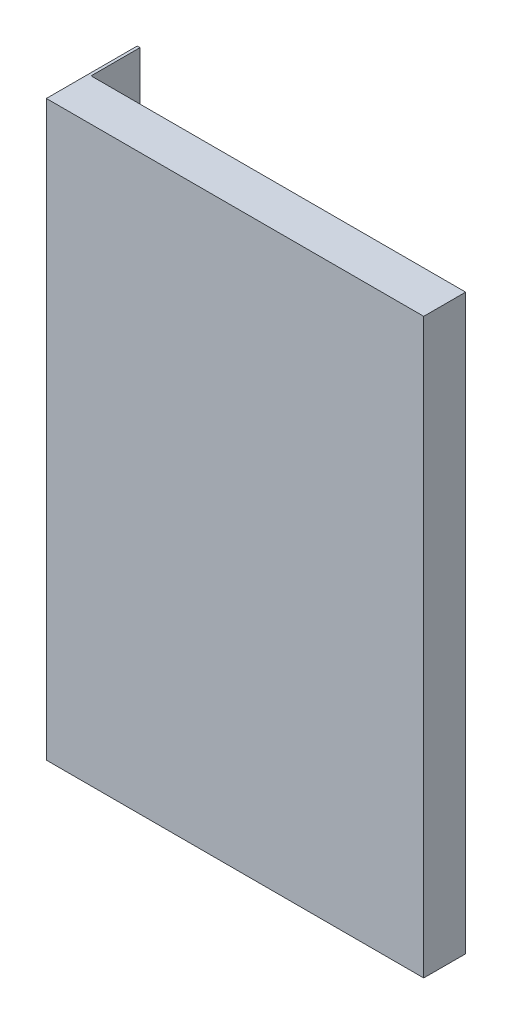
ISO-10303-21;
HEADER;
FILE_DESCRIPTION(('STEP AP214'),'2;1');
FILE_NAME('part.step','',(''),(''),'','','');
FILE_SCHEMA(('AUTOMOTIVE_DESIGN { 1 0 10303 214 1 1 1 1 }'));
ENDSEC;
DATA;
#1=APPLICATION_CONTEXT('core data for automotive mechanical design processes');
#2=APPLICATION_PROTOCOL_DEFINITION('international standard','automotive_design',2000,#1);
#3=PRODUCT_CONTEXT('',#1,'mechanical');
#4=PRODUCT('Part','Part','',(#3));
#5=PRODUCT_RELATED_PRODUCT_CATEGORY('part','',(#4));
#6=PRODUCT_DEFINITION_FORMATION('','',#4);
#7=PRODUCT_DEFINITION_CONTEXT('part definition',#1,'design');
#8=PRODUCT_DEFINITION('design','',#6,#7);
#9=PRODUCT_DEFINITION_SHAPE('','',#8);
#10=(LENGTH_UNIT() NAMED_UNIT(*) SI_UNIT(.MILLI.,.METRE.));
#11=(NAMED_UNIT(*) PLANE_ANGLE_UNIT() SI_UNIT($,.RADIAN.));
#12=(NAMED_UNIT(*) SI_UNIT($,.STERADIAN.) SOLID_ANGLE_UNIT());
#13=UNCERTAINTY_MEASURE_WITH_UNIT(LENGTH_MEASURE(1.E-05),#10,'distance_accuracy_value','');
#14=(GEOMETRIC_REPRESENTATION_CONTEXT(3) GLOBAL_UNCERTAINTY_ASSIGNED_CONTEXT((#13)) GLOBAL_UNIT_ASSIGNED_CONTEXT((#10,
#11,#12)) REPRESENTATION_CONTEXT('',''));
#15=CARTESIAN_POINT('',(0.,0.,0.));
#16=DIRECTION('',(0.,0.,1.));
#17=DIRECTION('',(1.,0.,0.));
#18=AXIS2_PLACEMENT_3D('',#15,#16,#17);
#19=CARTESIAN_POINT('',(-6.,-0.999999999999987,3.5));
#20=DIRECTION('',(-1.,0.,0.));
#21=DIRECTION('',(0.,-1.,0.));
#22=AXIS2_PLACEMENT_3D('',#19,#20,#21);
#23=PLANE('',#22);
#24=DIRECTION('',(0.,1.,0.));
#25=VECTOR('',#24,1.);
#26=CARTESIAN_POINT('',(-6.,-0.999999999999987,0.));
#27=LINE('',#26,#25);
#28=CARTESIAN_POINT('',(-6.,-11.,0.));
#29=VERTEX_POINT('',#28);
#30=CARTESIAN_POINT('',(-6.,-0.999999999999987,0.));
#31=VERTEX_POINT('',#30);
#32=EDGE_CURVE('E167',#29,#31,#27,.T.);
#33=ORIENTED_EDGE('',*,*,#32,.T.);
#34=DIRECTION('',(0.,0.,-1.));
#35=VECTOR('',#34,1.);
#36=CARTESIAN_POINT('',(-6.,-0.999999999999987,3.5));
#37=LINE('',#36,#35);
#38=CARTESIAN_POINT('',(-6.,-0.999999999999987,3.5));
#39=VERTEX_POINT('',#38);
#40=EDGE_CURVE('E11',#39,#31,#37,.T.);
#41=ORIENTED_EDGE('',*,*,#40,.F.);
#42=DIRECTION('',(0.,1.,0.));
#43=VECTOR('',#42,1.);
#44=CARTESIAN_POINT('',(-6.,-0.999999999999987,3.5));
#45=LINE('',#44,#43);
#46=CARTESIAN_POINT('',(-6.,-11.,3.5));
#47=VERTEX_POINT('',#46);
#48=EDGE_CURVE('E176',#47,#39,#45,.T.);
#49=ORIENTED_EDGE('',*,*,#48,.F.);
#50=DIRECTION('',(0.,0.,-1.));
#51=VECTOR('',#50,1.);
#52=CARTESIAN_POINT('',(-6.,-11.,3.5));
#53=LINE('',#52,#51);
#54=EDGE_CURVE('E188',#47,#29,#53,.T.);
#55=ORIENTED_EDGE('',*,*,#54,.T.);
#56=EDGE_LOOP('',(#33,#41,#49,#55));
#57=FACE_BOUND('',#56,.T.);
#58=ADVANCED_FACE('F35',(#57),#23,.F.);
#59=CARTESIAN_POINT('',(-6.,-0.999999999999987,3.5));
#60=DIRECTION('',(0.,-1.,0.));
#61=DIRECTION('',(1.,0.,0.));
#62=AXIS2_PLACEMENT_3D('',#59,#60,#61);
#63=PLANE('',#62);
#64=DIRECTION('',(-1.,0.,0.));
#65=VECTOR('',#64,1.);
#66=CARTESIAN_POINT('',(-6.,-0.999999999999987,0.));
#67=LINE('',#66,#65);
#68=CARTESIAN_POINT('',(-16.,-0.999999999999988,0.));
#69=VERTEX_POINT('',#68);
#70=EDGE_CURVE('E170',#31,#69,#67,.T.);
#71=ORIENTED_EDGE('',*,*,#70,.T.);
#72=DIRECTION('',(0.,0.,-1.));
#73=VECTOR('',#72,1.);
#74=CARTESIAN_POINT('',(-16.,-0.999999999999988,3.5));
#75=LINE('',#74,#73);
#76=CARTESIAN_POINT('',(-16.,-0.999999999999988,3.5));
#77=VERTEX_POINT('',#76);
#78=EDGE_CURVE('E42',#77,#69,#75,.T.);
#79=ORIENTED_EDGE('',*,*,#78,.F.);
#80=DIRECTION('',(-1.,0.,0.));
#81=VECTOR('',#80,1.);
#82=CARTESIAN_POINT('',(-6.,-0.999999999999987,3.5));
#83=LINE('',#82,#81);
#84=EDGE_CURVE('E179',#39,#77,#83,.T.);
#85=ORIENTED_EDGE('',*,*,#84,.F.);
#86=ORIENTED_EDGE('',*,*,#40,.T.);
#87=EDGE_LOOP('',(#71,#79,#85,#86));
#88=FACE_BOUND('',#87,.T.);
#89=ADVANCED_FACE('F204',(#88),#63,.F.);
#90=CARTESIAN_POINT('',(-16.,-0.999999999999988,3.5));
#91=DIRECTION('',(1.,0.,0.));
#92=DIRECTION('',(0.,0.,-1.));
#93=AXIS2_PLACEMENT_3D('',#90,#91,#92);
#94=PLANE('',#93);
#95=DIRECTION('',(0.,-1.,0.));
#96=VECTOR('',#95,1.);
#97=CARTESIAN_POINT('',(-16.,-0.999999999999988,0.));
#98=LINE('',#97,#96);
#99=CARTESIAN_POINT('',(-16.,-11.,0.));
#100=VERTEX_POINT('',#99);
#101=EDGE_CURVE('E172',#69,#100,#98,.T.);
#102=ORIENTED_EDGE('',*,*,#101,.T.);
#103=DIRECTION('',(0.,0.,-1.));
#104=VECTOR('',#103,1.);
#105=CARTESIAN_POINT('',(-16.,-11.,3.5));
#106=LINE('',#105,#104);
#107=CARTESIAN_POINT('',(-16.,-11.,3.5));
#108=VERTEX_POINT('',#107);
#109=EDGE_CURVE('E49',#108,#100,#106,.T.);
#110=ORIENTED_EDGE('',*,*,#109,.F.);
#111=DIRECTION('',(0.,-1.,0.));
#112=VECTOR('',#111,1.);
#113=CARTESIAN_POINT('',(-16.,-0.999999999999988,3.5));
#114=LINE('',#113,#112);
#115=EDGE_CURVE('E182',#77,#108,#114,.T.);
#116=ORIENTED_EDGE('',*,*,#115,.F.);
#117=ORIENTED_EDGE('',*,*,#78,.T.);
#118=EDGE_LOOP('',(#102,#110,#116,#117));
#119=FACE_BOUND('',#118,.T.);
#120=ADVANCED_FACE('F192',(#119),#94,.F.);
#121=CARTESIAN_POINT('',(-6.,-11.,3.5));
#122=DIRECTION('',(0.,1.,0.));
#123=DIRECTION('',(-1.,0.,0.));
#124=AXIS2_PLACEMENT_3D('',#121,#122,#123);
#125=PLANE('',#124);
#126=DIRECTION('',(1.,0.,0.));
#127=VECTOR('',#126,1.);
#128=CARTESIAN_POINT('',(-6.,-11.,0.));
#129=LINE('',#128,#127);
#130=EDGE_CURVE('E174',#100,#29,#129,.T.);
#131=ORIENTED_EDGE('',*,*,#130,.T.);
#132=ORIENTED_EDGE('',*,*,#54,.F.);
#133=DIRECTION('',(1.,0.,0.));
#134=VECTOR('',#133,1.);
#135=CARTESIAN_POINT('',(-6.,-11.,3.5));
#136=LINE('',#135,#134);
#137=EDGE_CURVE('E185',#108,#47,#136,.T.);
#138=ORIENTED_EDGE('',*,*,#137,.F.);
#139=ORIENTED_EDGE('',*,*,#109,.T.);
#140=EDGE_LOOP('',(#131,#132,#138,#139));
#141=FACE_BOUND('',#140,.T.);
#142=ADVANCED_FACE('F199',(#141),#125,.F.);
#143=CARTESIAN_POINT('',(-6.,-0.999999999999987,0.));
#144=DIRECTION('',(0.,0.,-1.));
#145=DIRECTION('',(-1.,0.,0.));
#146=AXIS2_PLACEMENT_3D('',#143,#144,#145);
#147=PLANE('',#146);
#148=ORIENTED_EDGE('',*,*,#32,.F.);
#149=ORIENTED_EDGE('',*,*,#130,.F.);
#150=ORIENTED_EDGE('',*,*,#101,.F.);
#151=ORIENTED_EDGE('',*,*,#70,.F.);
#152=EDGE_LOOP('',(#148,#149,#150,#151));
#153=FACE_BOUND('',#152,.T.);
#154=ADVANCED_FACE('F196',(#153),#147,.T.);
#155=CARTESIAN_POINT('',(-23.,-25.5,3.5));
#156=DIRECTION('',(0.,0.,1.));
#157=DIRECTION('',(1.,0.,0.));
#158=AXIS2_PLACEMENT_3D('',#155,#156,#157);
#159=PLANE('',#158);
#160=DIRECTION('',(1.,0.,0.));
#161=VECTOR('',#160,1.);
#162=CARTESIAN_POINT('',(-23.,-25.5,3.5));
#163=LINE('',#162,#161);
#164=CARTESIAN_POINT('',(-22.8,-25.5,3.5));
#165=VERTEX_POINT('',#164);
#166=CARTESIAN_POINT('',(4.00000000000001,-25.5,3.5));
#167=VERTEX_POINT('',#166);
#168=EDGE_CURVE('E147',#165,#167,#163,.T.);
#169=ORIENTED_EDGE('',*,*,#168,.F.);
#170=DIRECTION('',(0.,1.,0.));
#171=VECTOR('',#170,1.);
#172=CARTESIAN_POINT('',(-22.8,15.5,3.5));
#173=LINE('',#172,#171);
#174=CARTESIAN_POINT('',(-22.8,15.5,3.5));
#175=VERTEX_POINT('',#174);
#176=EDGE_CURVE('E137',#165,#175,#173,.T.);
#177=ORIENTED_EDGE('',*,*,#176,.T.);
#178=DIRECTION('',(-1.,0.,0.));
#179=VECTOR('',#178,1.);
#180=CARTESIAN_POINT('',(-23.,15.5,3.5));
#181=LINE('',#180,#179);
#182=CARTESIAN_POINT('',(4.,15.5,3.5));
#183=VERTEX_POINT('',#182);
#184=EDGE_CURVE('E152',#183,#175,#181,.T.);
#185=ORIENTED_EDGE('',*,*,#184,.F.);
#186=DIRECTION('',(0.,1.,0.));
#187=VECTOR('',#186,1.);
#188=CARTESIAN_POINT('',(4.,15.5,3.5));
#189=LINE('',#188,#187);
#190=EDGE_CURVE('E150',#167,#183,#189,.T.);
#191=ORIENTED_EDGE('',*,*,#190,.F.);
#192=EDGE_LOOP('',(#169,#177,#185,#191));
#193=FACE_BOUND('',#192,.T.);
#194=ORIENTED_EDGE('',*,*,#137,.T.);
#195=ORIENTED_EDGE('',*,*,#48,.T.);
#196=ORIENTED_EDGE('',*,*,#84,.T.);
#197=ORIENTED_EDGE('',*,*,#115,.T.);
#198=EDGE_LOOP('',(#194,#195,#196,#197));
#199=FACE_BOUND('',#198,.T.);
#200=ADVANCED_FACE('F203',(#193,#199),#159,.F.);
#201=CARTESIAN_POINT('',(-23.,15.5,6.5));
#202=DIRECTION('',(1.,0.,0.));
#203=DIRECTION('',(0.,1.,0.));
#204=AXIS2_PLACEMENT_3D('',#201,#202,#203);
#205=PLANE('',#204);
#206=DIRECTION('',(0.,0.,-1.));
#207=VECTOR('',#206,1.);
#208=CARTESIAN_POINT('',(-23.,15.5,6.5));
#209=LINE('',#208,#207);
#210=CARTESIAN_POINT('',(-23.,15.5,6.5));
#211=VERTEX_POINT('',#210);
#212=CARTESIAN_POINT('',(-23.,15.5,0.));
#213=VERTEX_POINT('',#212);
#214=EDGE_CURVE('E111',#211,#213,#209,.T.);
#215=ORIENTED_EDGE('',*,*,#214,.T.);
#216=DIRECTION('',(0.,-1.,0.));
#217=VECTOR('',#216,1.);
#218=CARTESIAN_POINT('',(-23.,15.5,0.));
#219=LINE('',#218,#217);
#220=CARTESIAN_POINT('',(-23.,-25.5,0.));
#221=VERTEX_POINT('',#220);
#222=EDGE_CURVE('E116',#213,#221,#219,.T.);
#223=ORIENTED_EDGE('',*,*,#222,.T.);
#224=DIRECTION('',(0.,0.,-1.));
#225=VECTOR('',#224,1.);
#226=CARTESIAN_POINT('',(-23.,-25.5,6.5));
#227=LINE('',#226,#225);
#228=CARTESIAN_POINT('',(-23.,-25.5,6.5));
#229=VERTEX_POINT('',#228);
#230=EDGE_CURVE('E165',#229,#221,#227,.T.);
#231=ORIENTED_EDGE('',*,*,#230,.F.);
#232=DIRECTION('',(0.,-1.,0.));
#233=VECTOR('',#232,1.);
#234=CARTESIAN_POINT('',(-23.,15.5,6.5));
#235=LINE('',#234,#233);
#236=EDGE_CURVE('E118',#211,#229,#235,.T.);
#237=ORIENTED_EDGE('',*,*,#236,.F.);
#238=EDGE_LOOP('',(#215,#223,#231,#237));
#239=FACE_BOUND('',#238,.T.);
#240=ADVANCED_FACE('F113',(#239),#205,.F.);
#241=CARTESIAN_POINT('',(-23.,-25.5,6.5));
#242=DIRECTION('',(0.,1.,0.));
#243=DIRECTION('',(0.,0.,1.));
#244=AXIS2_PLACEMENT_3D('',#241,#242,#243);
#245=PLANE('',#244);
#246=ORIENTED_EDGE('',*,*,#230,.T.);
#247=DIRECTION('',(-1.,0.,0.));
#248=VECTOR('',#247,1.);
#249=CARTESIAN_POINT('',(-22.8,-25.5,0.));
#250=LINE('',#249,#248);
#251=CARTESIAN_POINT('',(-22.8,-25.5,0.));
#252=VERTEX_POINT('',#251);
#253=EDGE_CURVE('E132',#252,#221,#250,.T.);
#254=ORIENTED_EDGE('',*,*,#253,.F.);
#255=DIRECTION('',(0.,0.,1.));
#256=VECTOR('',#255,1.);
#257=CARTESIAN_POINT('',(-22.8,-25.5,3.5));
#258=LINE('',#257,#256);
#259=EDGE_CURVE('E133',#252,#165,#258,.T.);
#260=ORIENTED_EDGE('',*,*,#259,.T.);
#261=ORIENTED_EDGE('',*,*,#168,.T.);
#262=DIRECTION('',(0.,0.,-1.));
#263=VECTOR('',#262,1.);
#264=CARTESIAN_POINT('',(4.00000000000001,-25.5,6.5));
#265=LINE('',#264,#263);
#266=CARTESIAN_POINT('',(4.00000000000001,-25.5,6.5));
#267=VERTEX_POINT('',#266);
#268=EDGE_CURVE('E162',#267,#167,#265,.T.);
#269=ORIENTED_EDGE('',*,*,#268,.F.);
#270=DIRECTION('',(1.,0.,0.));
#271=VECTOR('',#270,1.);
#272=CARTESIAN_POINT('',(-23.,-25.5,6.5));
#273=LINE('',#272,#271);
#274=EDGE_CURVE('E155',#229,#267,#273,.T.);
#275=ORIENTED_EDGE('',*,*,#274,.F.);
#276=EDGE_LOOP('',(#246,#254,#260,#261,#269,#275));
#277=FACE_BOUND('',#276,.T.);
#278=ADVANCED_FACE('F218',(#277),#245,.F.);
#279=CARTESIAN_POINT('',(4.,15.5,6.5));
#280=DIRECTION('',(-1.,0.,0.));
#281=DIRECTION('',(0.,-1.,0.));
#282=AXIS2_PLACEMENT_3D('',#279,#280,#281);
#283=PLANE('',#282);
#284=ORIENTED_EDGE('',*,*,#190,.T.);
#285=DIRECTION('',(0.,0.,-1.));
#286=VECTOR('',#285,1.);
#287=CARTESIAN_POINT('',(4.,15.5,6.5));
#288=LINE('',#287,#286);
#289=CARTESIAN_POINT('',(4.,15.5,6.5));
#290=VERTEX_POINT('',#289);
#291=EDGE_CURVE('E121',#290,#183,#288,.T.);
#292=ORIENTED_EDGE('',*,*,#291,.F.);
#293=DIRECTION('',(0.,1.,0.));
#294=VECTOR('',#293,1.);
#295=CARTESIAN_POINT('',(4.,15.5,6.5));
#296=LINE('',#295,#294);
#297=EDGE_CURVE('E157',#267,#290,#296,.T.);
#298=ORIENTED_EDGE('',*,*,#297,.F.);
#299=ORIENTED_EDGE('',*,*,#268,.T.);
#300=EDGE_LOOP('',(#284,#292,#298,#299));
#301=FACE_BOUND('',#300,.T.);
#302=ADVANCED_FACE('F221',(#301),#283,.F.);
#303=CARTESIAN_POINT('',(-23.,15.5,6.5));
#304=DIRECTION('',(0.,-1.,0.));
#305=DIRECTION('',(0.,0.,-1.));
#306=AXIS2_PLACEMENT_3D('',#303,#304,#305);
#307=PLANE('',#306);
#308=ORIENTED_EDGE('',*,*,#184,.T.);
#309=DIRECTION('',(0.,0.,-1.));
#310=VECTOR('',#309,1.);
#311=CARTESIAN_POINT('',(-22.8,15.5,3.5));
#312=LINE('',#311,#310);
#313=CARTESIAN_POINT('',(-22.8,15.5,0.));
#314=VERTEX_POINT('',#313);
#315=EDGE_CURVE('E128',#175,#314,#312,.T.);
#316=ORIENTED_EDGE('',*,*,#315,.T.);
#317=DIRECTION('',(-1.,0.,0.));
#318=VECTOR('',#317,1.);
#319=CARTESIAN_POINT('',(-22.8,15.5,0.));
#320=LINE('',#319,#318);
#321=EDGE_CURVE('E125',#314,#213,#320,.T.);
#322=ORIENTED_EDGE('',*,*,#321,.T.);
#323=ORIENTED_EDGE('',*,*,#214,.F.);
#324=DIRECTION('',(-1.,0.,0.));
#325=VECTOR('',#324,1.);
#326=CARTESIAN_POINT('',(-23.,15.5,6.5));
#327=LINE('',#326,#325);
#328=EDGE_CURVE('E122',#290,#211,#327,.T.);
#329=ORIENTED_EDGE('',*,*,#328,.F.);
#330=ORIENTED_EDGE('',*,*,#291,.T.);
#331=EDGE_LOOP('',(#308,#316,#322,#323,#329,#330));
#332=FACE_BOUND('',#331,.T.);
#333=ADVANCED_FACE('F127',(#332),#307,.F.);
#334=CARTESIAN_POINT('',(-23.,-25.5,6.5));
#335=DIRECTION('',(0.,0.,1.));
#336=DIRECTION('',(1.,0.,0.));
#337=AXIS2_PLACEMENT_3D('',#334,#335,#336);
#338=PLANE('',#337);
#339=ORIENTED_EDGE('',*,*,#236,.T.);
#340=ORIENTED_EDGE('',*,*,#274,.T.);
#341=ORIENTED_EDGE('',*,*,#297,.T.);
#342=ORIENTED_EDGE('',*,*,#328,.T.);
#343=EDGE_LOOP('',(#339,#340,#341,#342));
#344=FACE_BOUND('',#343,.T.);
#345=ADVANCED_FACE('F228',(#344),#338,.T.);
#346=CARTESIAN_POINT('',(-22.8,15.5,0.));
#347=DIRECTION('',(0.,0.,-1.));
#348=DIRECTION('',(0.,1.,0.));
#349=AXIS2_PLACEMENT_3D('',#346,#347,#348);
#350=PLANE('',#349);
#351=ORIENTED_EDGE('',*,*,#222,.F.);
#352=ORIENTED_EDGE('',*,*,#321,.F.);
#353=DIRECTION('',(0.,-1.,0.));
#354=VECTOR('',#353,1.);
#355=CARTESIAN_POINT('',(-22.8,15.5,0.));
#356=LINE('',#355,#354);
#357=EDGE_CURVE('E143',#314,#252,#356,.T.);
#358=ORIENTED_EDGE('',*,*,#357,.T.);
#359=ORIENTED_EDGE('',*,*,#253,.T.);
#360=EDGE_LOOP('',(#351,#352,#358,#359));
#361=FACE_BOUND('',#360,.T.);
#362=ADVANCED_FACE('F136',(#361),#350,.T.);
#363=CARTESIAN_POINT('',(-22.8,-25.5,3.5));
#364=DIRECTION('',(1.,0.,0.));
#365=DIRECTION('',(0.,1.,0.));
#366=AXIS2_PLACEMENT_3D('',#363,#364,#365);
#367=PLANE('',#366);
#368=ORIENTED_EDGE('',*,*,#176,.F.);
#369=ORIENTED_EDGE('',*,*,#259,.F.);
#370=ORIENTED_EDGE('',*,*,#357,.F.);
#371=ORIENTED_EDGE('',*,*,#315,.F.);
#372=EDGE_LOOP('',(#368,#369,#370,#371));
#373=FACE_BOUND('',#372,.T.);
#374=ADVANCED_FACE('F237',(#373),#367,.T.);
#375=CLOSED_SHELL('',(#58,#89,#120,#142,#154,#200,#240,#278,#302,#333,#345,#362,#374));
#376=MANIFOLD_SOLID_BREP('B2',#375);
#377=ADVANCED_BREP_SHAPE_REPRESENTATION('',(#18,#376),#14);
#378=SHAPE_DEFINITION_REPRESENTATION(#9,#377);
ENDSEC;
END-ISO-10303-21;
